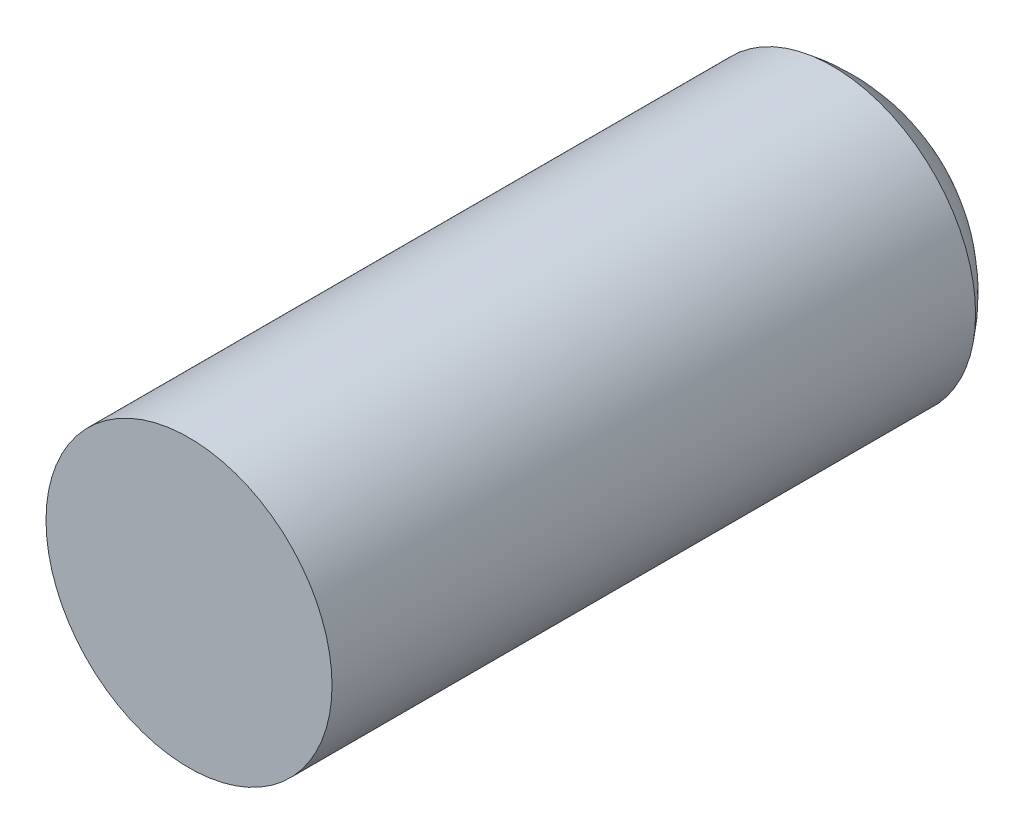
ISO-10303-21;
HEADER;
FILE_DESCRIPTION(('STEP AP214'),'2;1');
FILE_NAME('part.step','',(''),(''),'','','');
FILE_SCHEMA(('AUTOMOTIVE_DESIGN { 1 0 10303 214 1 1 1 1 }'));
ENDSEC;
DATA;
#1=APPLICATION_CONTEXT('core data for automotive mechanical design processes');
#2=APPLICATION_PROTOCOL_DEFINITION('international standard','automotive_design',2000,#1);
#3=PRODUCT_CONTEXT('',#1,'mechanical');
#4=PRODUCT('Part','Part','',(#3));
#5=PRODUCT_RELATED_PRODUCT_CATEGORY('part','',(#4));
#6=PRODUCT_DEFINITION_FORMATION('','',#4);
#7=PRODUCT_DEFINITION_CONTEXT('part definition',#1,'design');
#8=PRODUCT_DEFINITION('design','',#6,#7);
#9=PRODUCT_DEFINITION_SHAPE('','',#8);
#10=(LENGTH_UNIT() NAMED_UNIT(*) SI_UNIT(.MILLI.,.METRE.));
#11=(NAMED_UNIT(*) PLANE_ANGLE_UNIT() SI_UNIT($,.RADIAN.));
#12=(NAMED_UNIT(*) SI_UNIT($,.STERADIAN.) SOLID_ANGLE_UNIT());
#13=UNCERTAINTY_MEASURE_WITH_UNIT(LENGTH_MEASURE(1.E-05),#10,'distance_accuracy_value','');
#14=(GEOMETRIC_REPRESENTATION_CONTEXT(3) GLOBAL_UNCERTAINTY_ASSIGNED_CONTEXT((#13)) GLOBAL_UNIT_ASSIGNED_CONTEXT((#10,
#11,#12)) REPRESENTATION_CONTEXT('',''));
#15=CARTESIAN_POINT('',(0.,0.,0.));
#16=DIRECTION('',(0.,0.,1.));
#17=DIRECTION('',(1.,0.,0.));
#18=AXIS2_PLACEMENT_3D('',#15,#16,#17);
#19=CARTESIAN_POINT('',(0.,0.,-10.));
#20=DIRECTION('',(0.,0.,1.));
#21=DIRECTION('',(1.,0.,0.));
#22=AXIS2_PLACEMENT_3D('',#19,#20,#21);
#23=CYLINDRICAL_SURFACE('',#22,2.);
#24=CARTESIAN_POINT('',(0.,0.,-9.));
#25=DIRECTION('',(0.,0.,-1.));
#26=DIRECTION('',(-1.,0.,0.));
#27=AXIS2_PLACEMENT_3D('',#24,#25,#26);
#28=CIRCLE('',#27,2.);
#29=CARTESIAN_POINT('',(-2.,0.,-9.));
#30=VERTEX_POINT('',#29);
#31=EDGE_CURVE('E40',#30,#30,#28,.T.);
#32=ORIENTED_EDGE('',*,*,#31,.F.);
#33=EDGE_LOOP('',(#32));
#34=FACE_BOUND('',#33,.T.);
#35=CARTESIAN_POINT('',(0.,0.,0.));
#36=DIRECTION('',(0.,0.,1.));
#37=DIRECTION('',(1.,0.,0.));
#38=AXIS2_PLACEMENT_3D('',#35,#36,#37);
#39=CIRCLE('',#38,2.);
#40=CARTESIAN_POINT('',(2.,0.,0.));
#41=VERTEX_POINT('',#40);
#42=EDGE_CURVE('E11',#41,#41,#39,.T.);
#43=ORIENTED_EDGE('',*,*,#42,.F.);
#44=EDGE_LOOP('',(#43));
#45=FACE_BOUND('',#44,.T.);
#46=ADVANCED_FACE('F34',(#34,#45),#23,.T.);
#47=CARTESIAN_POINT('',(0.,0.,0.));
#48=DIRECTION('',(0.,0.,1.));
#49=DIRECTION('',(1.,0.,0.));
#50=AXIS2_PLACEMENT_3D('',#47,#48,#49);
#51=PLANE('',#50);
#52=ORIENTED_EDGE('',*,*,#42,.T.);
#53=EDGE_LOOP('',(#52));
#54=FACE_BOUND('',#53,.T.);
#55=ADVANCED_FACE('F46',(#54),#51,.T.);
#56=CARTESIAN_POINT('',(0.,0.,-7.5));
#57=DIRECTION('',(0.,0.,-1.));
#58=DIRECTION('',(0.,-1.,0.));
#59=AXIS2_PLACEMENT_3D('',#56,#57,#58);
#60=SPHERICAL_SURFACE('',#59,2.5);
#61=CARTESIAN_POINT('',(0.,0.,-10.));
#62=VERTEX_POINT('',#61);
#63=VERTEX_LOOP('',#62);
#64=FACE_BOUND('',#63,.T.);
#65=ORIENTED_EDGE('',*,*,#31,.T.);
#66=EDGE_LOOP('',(#65));
#67=FACE_BOUND('',#66,.T.);
#68=ADVANCED_FACE('F43',(#64,#67),#60,.T.);
#69=CLOSED_SHELL('',(#46,#55,#68));
#70=MANIFOLD_SOLID_BREP('B2',#69);
#71=ADVANCED_BREP_SHAPE_REPRESENTATION('',(#18,#70),#14);
#72=SHAPE_DEFINITION_REPRESENTATION(#9,#71);
ENDSEC;
END-ISO-10303-21;
